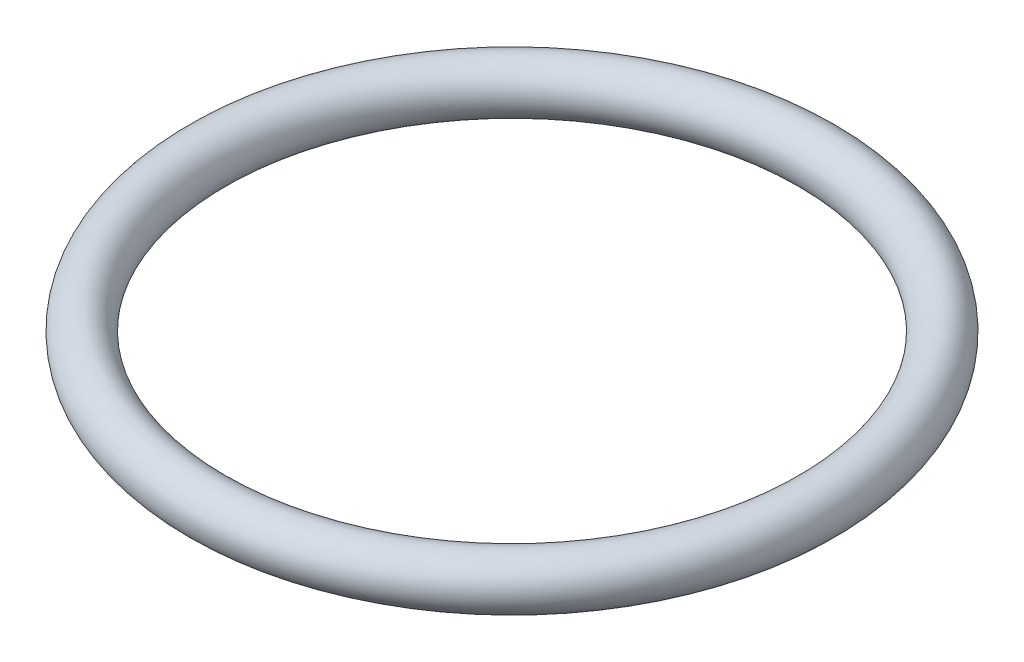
ISO-10303-21;
HEADER;
FILE_DESCRIPTION(('STEP AP214'),'2;1');
FILE_NAME('part.step','',(''),(''),'','','');
FILE_SCHEMA(('AUTOMOTIVE_DESIGN { 1 0 10303 214 1 1 1 1 }'));
ENDSEC;
DATA;
#1=APPLICATION_CONTEXT('core data for automotive mechanical design processes');
#2=APPLICATION_PROTOCOL_DEFINITION('international standard','automotive_design',2000,#1);
#3=PRODUCT_CONTEXT('',#1,'mechanical');
#4=PRODUCT('Part','Part','',(#3));
#5=PRODUCT_RELATED_PRODUCT_CATEGORY('part','',(#4));
#6=PRODUCT_DEFINITION_FORMATION('','',#4);
#7=PRODUCT_DEFINITION_CONTEXT('part definition',#1,'design');
#8=PRODUCT_DEFINITION('design','',#6,#7);
#9=PRODUCT_DEFINITION_SHAPE('','',#8);
#10=(LENGTH_UNIT() NAMED_UNIT(*) SI_UNIT(.MILLI.,.METRE.));
#11=(NAMED_UNIT(*) PLANE_ANGLE_UNIT() SI_UNIT($,.RADIAN.));
#12=(NAMED_UNIT(*) SI_UNIT($,.STERADIAN.) SOLID_ANGLE_UNIT());
#13=UNCERTAINTY_MEASURE_WITH_UNIT(LENGTH_MEASURE(1.E-05),#10,'distance_accuracy_value','');
#14=(GEOMETRIC_REPRESENTATION_CONTEXT(3) GLOBAL_UNCERTAINTY_ASSIGNED_CONTEXT((#13)) GLOBAL_UNIT_ASSIGNED_CONTEXT((#10,
#11,#12)) REPRESENTATION_CONTEXT('',''));
#15=CARTESIAN_POINT('',(0.,0.,0.));
#16=DIRECTION('',(0.,0.,1.));
#17=DIRECTION('',(1.,0.,0.));
#18=AXIS2_PLACEMENT_3D('',#15,#16,#17);
#19=CARTESIAN_POINT('',(0.,0.,0.));
#20=DIRECTION('',(0.,-1.,0.));
#21=DIRECTION('',(0.,0.,-1.));
#22=AXIS2_PLACEMENT_3D('',#19,#20,#21);
#23=TOROIDAL_SURFACE('',#22,15.76,1.31);
#24=CARTESIAN_POINT('',(0.,0.,-17.07));
#25=VERTEX_POINT('',#24);
#26=VERTEX_LOOP('',#25);
#27=FACE_BOUND('',#26,.T.);
#28=ADVANCED_FACE('F29',(#27),#23,.T.);
#29=CLOSED_SHELL('',(#28));
#30=MANIFOLD_SOLID_BREP('B2',#29);
#31=ADVANCED_BREP_SHAPE_REPRESENTATION('',(#18,#30),#14);
#32=SHAPE_DEFINITION_REPRESENTATION(#9,#31);
ENDSEC;
END-ISO-10303-21;
